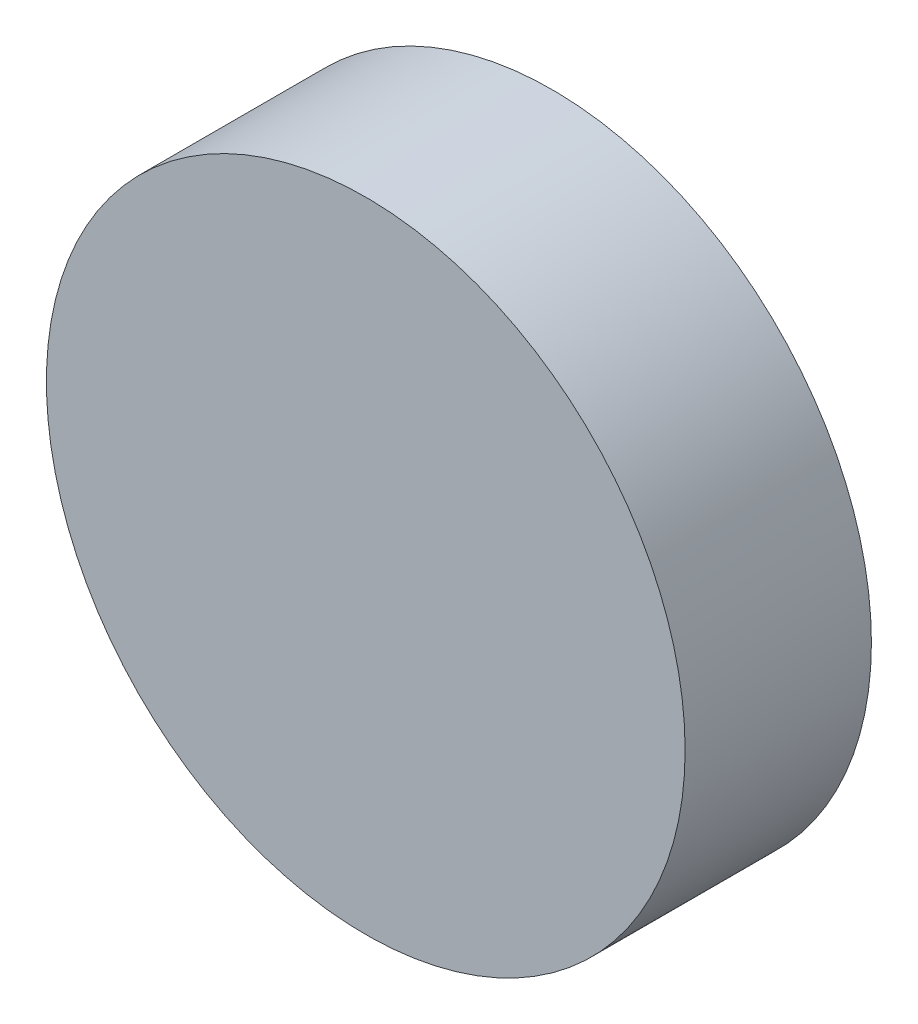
from build123d import *

# Parameters (mm, degrees)
ESQUISSE1_R      = 6
EXTRUSION1_DEPTH = 3.5


with BuildPart() as part:
    # Esquisse1 → Extrusion1 (new body)
    with BuildSketch(Plane.XY):
        Circle(ESQUISSE1_R)
    extrude(amount=EXTRUSION1_DEPTH)


solid = part.part
